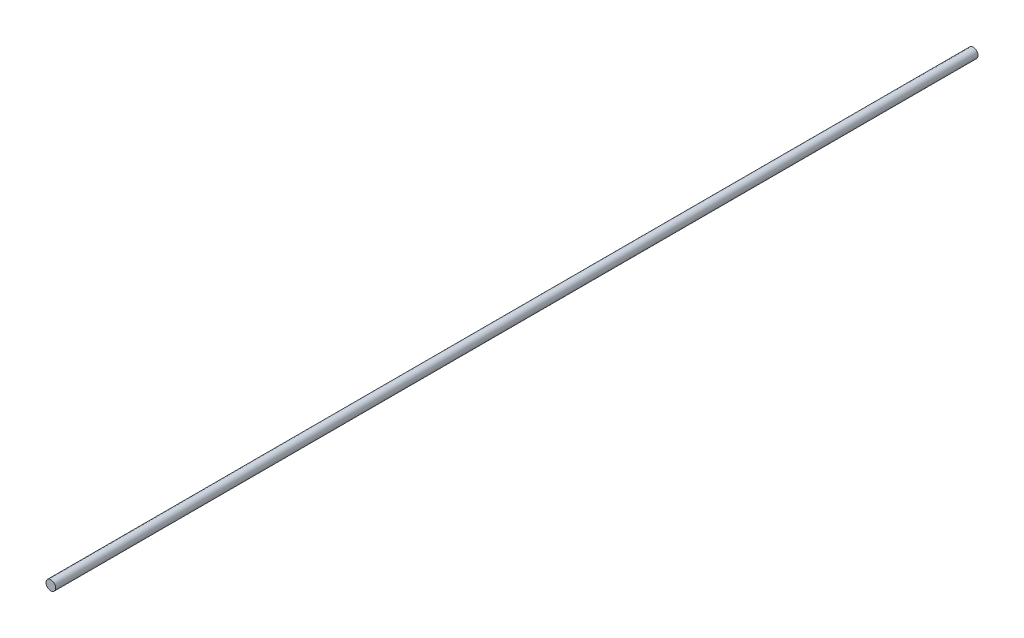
from build123d import *

# Parameters (mm, degrees)
SKETCH1_R           = 30
BOSS_EXTRUDE1_DEPTH = 5750


with BuildPart() as part:
    # Sketch1 → Boss-Extrude1 (new body)
    with BuildSketch(Plane.XY):
        Circle(SKETCH1_R)
    extrude(amount=-BOSS_EXTRUDE1_DEPTH)


solid = part.part
